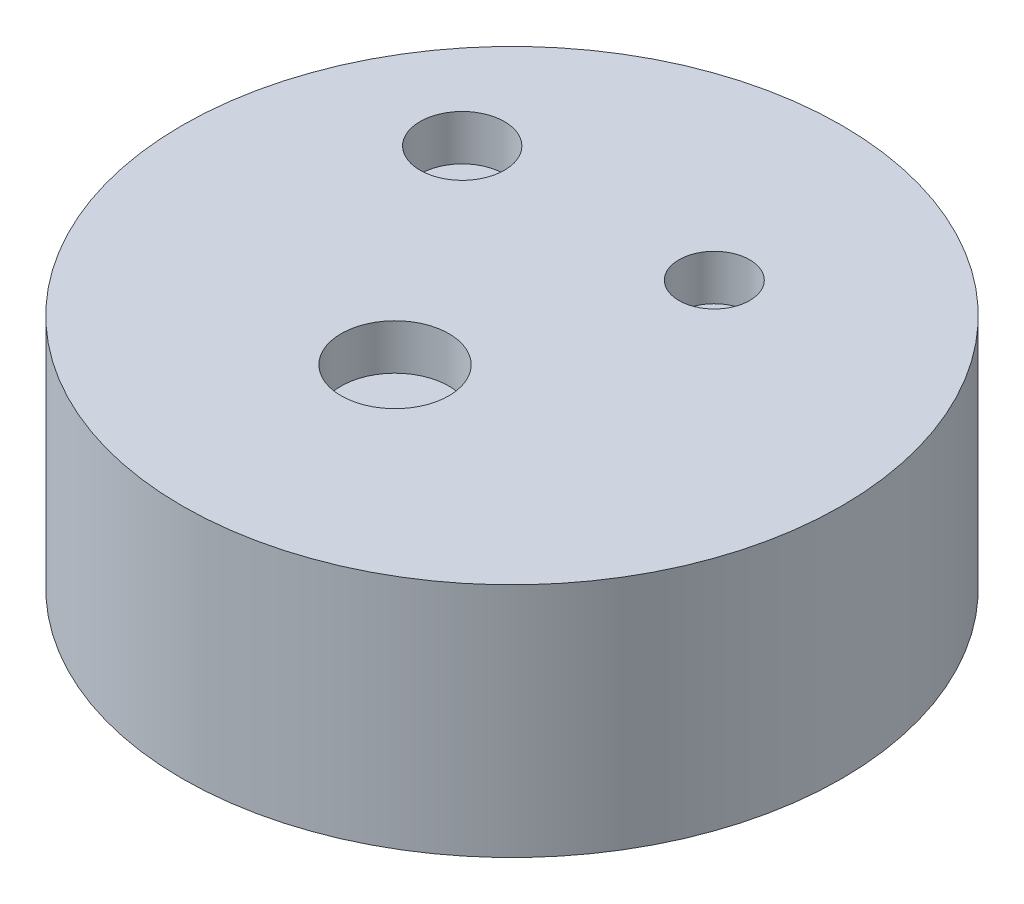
ISO-10303-21;
HEADER;
FILE_DESCRIPTION(('STEP AP214'),'2;1');
FILE_NAME('part.step','',(''),(''),'','','');
FILE_SCHEMA(('AUTOMOTIVE_DESIGN { 1 0 10303 214 1 1 1 1 }'));
ENDSEC;
DATA;
#1=APPLICATION_CONTEXT('core data for automotive mechanical design processes');
#2=APPLICATION_PROTOCOL_DEFINITION('international standard','automotive_design',2000,#1);
#3=PRODUCT_CONTEXT('',#1,'mechanical');
#4=PRODUCT('Part','Part','',(#3));
#5=PRODUCT_RELATED_PRODUCT_CATEGORY('part','',(#4));
#6=PRODUCT_DEFINITION_FORMATION('','',#4);
#7=PRODUCT_DEFINITION_CONTEXT('part definition',#1,'design');
#8=PRODUCT_DEFINITION('design','',#6,#7);
#9=PRODUCT_DEFINITION_SHAPE('','',#8);
#10=(LENGTH_UNIT() NAMED_UNIT(*) SI_UNIT(.MILLI.,.METRE.));
#11=(NAMED_UNIT(*) PLANE_ANGLE_UNIT() SI_UNIT($,.RADIAN.));
#12=(NAMED_UNIT(*) SI_UNIT($,.STERADIAN.) SOLID_ANGLE_UNIT());
#13=UNCERTAINTY_MEASURE_WITH_UNIT(LENGTH_MEASURE(1.E-05),#10,'distance_accuracy_value','');
#14=(GEOMETRIC_REPRESENTATION_CONTEXT(3) GLOBAL_UNCERTAINTY_ASSIGNED_CONTEXT((#13)) GLOBAL_UNIT_ASSIGNED_CONTEXT((#10,
#11,#12)) REPRESENTATION_CONTEXT('',''));
#15=CARTESIAN_POINT('',(0.,0.,0.));
#16=DIRECTION('',(0.,0.,1.));
#17=DIRECTION('',(1.,0.,0.));
#18=AXIS2_PLACEMENT_3D('',#15,#16,#17);
#19=CARTESIAN_POINT('',(0.,26.416,0.));
#20=DIRECTION('',(0.,-1.,0.));
#21=DIRECTION('',(0.,0.,-1.));
#22=AXIS2_PLACEMENT_3D('',#19,#20,#21);
#23=CYLINDRICAL_SURFACE('',#22,36.8716737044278);
#24=CARTESIAN_POINT('',(0.,26.416,0.));
#25=DIRECTION('',(0.,1.,0.));
#26=DIRECTION('',(0.,0.,1.));
#27=AXIS2_PLACEMENT_3D('',#24,#25,#26);
#28=CIRCLE('',#27,36.8716737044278);
#29=CARTESIAN_POINT('',(0.,26.416,36.8716737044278));
#30=VERTEX_POINT('',#29);
#31=EDGE_CURVE('E10',#30,#30,#28,.T.);
#32=ORIENTED_EDGE('',*,*,#31,.F.);
#33=EDGE_LOOP('',(#32));
#34=FACE_BOUND('',#33,.T.);
#35=CARTESIAN_POINT('',(0.,0.,0.));
#36=DIRECTION('',(0.,1.,0.));
#37=DIRECTION('',(0.,0.,1.));
#38=AXIS2_PLACEMENT_3D('',#35,#36,#37);
#39=CIRCLE('',#38,36.8716737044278);
#40=CARTESIAN_POINT('',(0.,0.,36.8716737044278));
#41=VERTEX_POINT('',#40);
#42=EDGE_CURVE('E37',#41,#41,#39,.T.);
#43=ORIENTED_EDGE('',*,*,#42,.T.);
#44=EDGE_LOOP('',(#43));
#45=FACE_BOUND('',#44,.T.);
#46=ADVANCED_FACE('F34',(#34,#45),#23,.T.);
#47=CARTESIAN_POINT('',(0.,26.416,0.));
#48=DIRECTION('',(0.,1.,0.));
#49=DIRECTION('',(0.,0.,1.));
#50=AXIS2_PLACEMENT_3D('',#47,#48,#49);
#51=PLANE('',#50);
#52=CARTESIAN_POINT('',(-19.2212117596,26.416,-13.6555200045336));
#53=DIRECTION('',(0.,1.,0.));
#54=DIRECTION('',(0.,0.,1.));
#55=AXIS2_PLACEMENT_3D('',#52,#53,#54);
#56=CIRCLE('',#55,4.71940122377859);
#57=CARTESIAN_POINT('',(-19.2212117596,26.416,-8.93611878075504));
#58=VERTEX_POINT('',#57);
#59=EDGE_CURVE('E58',#58,#58,#56,.T.);
#60=ORIENTED_EDGE('',*,*,#59,.F.);
#61=EDGE_LOOP('',(#60));
#62=FACE_BOUND('',#61,.T.);
#63=CARTESIAN_POINT('',(7.876648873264,26.416,-14.7482386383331));
#64=DIRECTION('',(0.,1.,0.));
#65=DIRECTION('',(0.,0.,1.));
#66=AXIS2_PLACEMENT_3D('',#63,#64,#65);
#67=CIRCLE('',#66,3.95619356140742);
#68=CARTESIAN_POINT('',(7.876648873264,26.416,-10.7920450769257));
#69=VERTEX_POINT('',#68);
#70=EDGE_CURVE('E52',#69,#69,#67,.T.);
#71=ORIENTED_EDGE('',*,*,#70,.F.);
#72=EDGE_LOOP('',(#71));
#73=FACE_BOUND('',#72,.T.);
#74=CARTESIAN_POINT('',(-1.78644802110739,26.416,11.2952486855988));
#75=DIRECTION('',(0.,1.,0.));
#76=DIRECTION('',(0.,0.,1.));
#77=AXIS2_PLACEMENT_3D('',#74,#75,#76);
#78=CIRCLE('',#77,6.02548741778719);
#79=CARTESIAN_POINT('',(-1.78644802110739,26.416,17.320736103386));
#80=VERTEX_POINT('',#79);
#81=EDGE_CURVE('E46',#80,#80,#78,.T.);
#82=ORIENTED_EDGE('',*,*,#81,.F.);
#83=EDGE_LOOP('',(#82));
#84=FACE_BOUND('',#83,.T.);
#85=ORIENTED_EDGE('',*,*,#31,.T.);
#86=EDGE_LOOP('',(#85));
#87=FACE_BOUND('',#86,.T.);
#88=ADVANCED_FACE('F73',(#62,#73,#84,#87),#51,.T.);
#89=CARTESIAN_POINT('',(0.,0.,0.));
#90=DIRECTION('',(0.,1.,0.));
#91=DIRECTION('',(0.,0.,1.));
#92=AXIS2_PLACEMENT_3D('',#89,#90,#91);
#93=PLANE('',#92);
#94=ORIENTED_EDGE('',*,*,#42,.F.);
#95=EDGE_LOOP('',(#94));
#96=FACE_BOUND('',#95,.T.);
#97=ADVANCED_FACE('F76',(#96),#93,.F.);
#98=CARTESIAN_POINT('',(-1.78644802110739,21.336,11.2952486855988));
#99=DIRECTION('',(0.,1.,0.));
#100=DIRECTION('',(0.,0.,1.));
#101=AXIS2_PLACEMENT_3D('',#98,#99,#100);
#102=CYLINDRICAL_SURFACE('',#101,6.02548741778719);
#103=CARTESIAN_POINT('',(-1.78644802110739,21.336,11.2952486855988));
#104=DIRECTION('',(0.,1.,0.));
#105=DIRECTION('',(0.,0.,1.));
#106=AXIS2_PLACEMENT_3D('',#103,#104,#105);
#107=CIRCLE('',#106,6.02548741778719);
#108=CARTESIAN_POINT('',(-1.78644802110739,21.336,17.320736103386));
#109=VERTEX_POINT('',#108);
#110=EDGE_CURVE('E49',#109,#109,#107,.T.);
#111=ORIENTED_EDGE('',*,*,#110,.F.);
#112=EDGE_LOOP('',(#111));
#113=FACE_BOUND('',#112,.T.);
#114=ORIENTED_EDGE('',*,*,#81,.T.);
#115=EDGE_LOOP('',(#114));
#116=FACE_BOUND('',#115,.T.);
#117=ADVANCED_FACE('F82',(#113,#116),#102,.F.);
#118=CARTESIAN_POINT('',(-1.78644802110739,21.336,11.2952486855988));
#119=DIRECTION('',(0.,1.,0.));
#120=DIRECTION('',(0.,0.,1.));
#121=AXIS2_PLACEMENT_3D('',#118,#119,#120);
#122=PLANE('',#121);
#123=ORIENTED_EDGE('',*,*,#110,.T.);
#124=EDGE_LOOP('',(#123));
#125=FACE_BOUND('',#124,.T.);
#126=ADVANCED_FACE('F84',(#125),#122,.T.);
#127=CARTESIAN_POINT('',(7.876648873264,21.336,-14.7482386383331));
#128=DIRECTION('',(0.,1.,0.));
#129=DIRECTION('',(0.,0.,1.));
#130=AXIS2_PLACEMENT_3D('',#127,#128,#129);
#131=CYLINDRICAL_SURFACE('',#130,3.95619356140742);
#132=CARTESIAN_POINT('',(7.876648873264,21.336,-14.7482386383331));
#133=DIRECTION('',(0.,1.,0.));
#134=DIRECTION('',(0.,0.,1.));
#135=AXIS2_PLACEMENT_3D('',#132,#133,#134);
#136=CIRCLE('',#135,3.95619356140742);
#137=CARTESIAN_POINT('',(7.876648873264,21.336,-10.7920450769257));
#138=VERTEX_POINT('',#137);
#139=EDGE_CURVE('E55',#138,#138,#136,.T.);
#140=ORIENTED_EDGE('',*,*,#139,.F.);
#141=EDGE_LOOP('',(#140));
#142=FACE_BOUND('',#141,.T.);
#143=ORIENTED_EDGE('',*,*,#70,.T.);
#144=EDGE_LOOP('',(#143));
#145=FACE_BOUND('',#144,.T.);
#146=ADVANCED_FACE('F91',(#142,#145),#131,.F.);
#147=CARTESIAN_POINT('',(7.876648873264,21.336,-14.7482386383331));
#148=DIRECTION('',(0.,1.,0.));
#149=DIRECTION('',(0.,0.,1.));
#150=AXIS2_PLACEMENT_3D('',#147,#148,#149);
#151=PLANE('',#150);
#152=ORIENTED_EDGE('',*,*,#139,.T.);
#153=EDGE_LOOP('',(#152));
#154=FACE_BOUND('',#153,.T.);
#155=ADVANCED_FACE('F69',(#154),#151,.T.);
#156=CARTESIAN_POINT('',(-19.2212117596,21.336,-13.6555200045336));
#157=DIRECTION('',(0.,1.,0.));
#158=DIRECTION('',(0.,0.,1.));
#159=AXIS2_PLACEMENT_3D('',#156,#157,#158);
#160=CYLINDRICAL_SURFACE('',#159,4.71940122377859);
#161=CARTESIAN_POINT('',(-19.2212117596,21.336,-13.6555200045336));
#162=DIRECTION('',(0.,1.,0.));
#163=DIRECTION('',(0.,0.,1.));
#164=AXIS2_PLACEMENT_3D('',#161,#162,#163);
#165=CIRCLE('',#164,4.71940122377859);
#166=CARTESIAN_POINT('',(-19.2212117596,21.336,-8.93611878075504));
#167=VERTEX_POINT('',#166);
#168=EDGE_CURVE('E44',#167,#167,#165,.T.);
#169=ORIENTED_EDGE('',*,*,#168,.F.);
#170=EDGE_LOOP('',(#169));
#171=FACE_BOUND('',#170,.T.);
#172=ORIENTED_EDGE('',*,*,#59,.T.);
#173=EDGE_LOOP('',(#172));
#174=FACE_BOUND('',#173,.T.);
#175=ADVANCED_FACE('F66',(#171,#174),#160,.F.);
#176=CARTESIAN_POINT('',(-19.2212117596,21.336,-13.6555200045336));
#177=DIRECTION('',(0.,1.,0.));
#178=DIRECTION('',(0.,0.,1.));
#179=AXIS2_PLACEMENT_3D('',#176,#177,#178);
#180=PLANE('',#179);
#181=ORIENTED_EDGE('',*,*,#168,.T.);
#182=EDGE_LOOP('',(#181));
#183=FACE_BOUND('',#182,.T.);
#184=ADVANCED_FACE('F64',(#183),#180,.T.);
#185=CLOSED_SHELL('',(#46,#88,#97,#117,#126,#146,#155,#175,#184));
#186=MANIFOLD_SOLID_BREP('B2',#185);
#187=ADVANCED_BREP_SHAPE_REPRESENTATION('',(#18,#186),#14);
#188=SHAPE_DEFINITION_REPRESENTATION(#9,#187);
ENDSEC;
END-ISO-10303-21;
